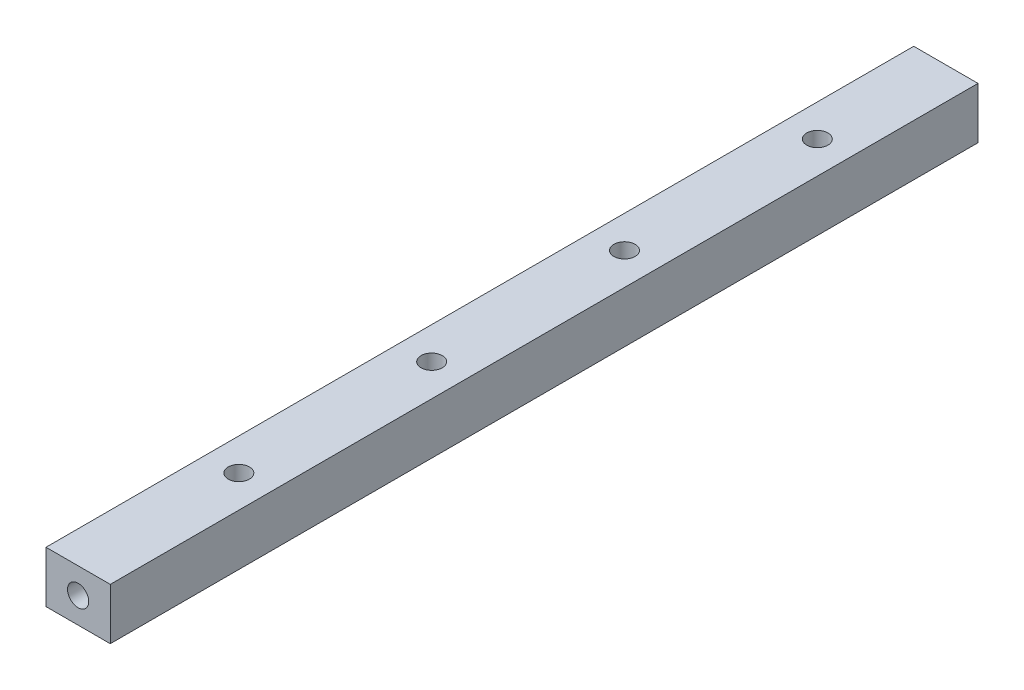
ISO-10303-21;
HEADER;
FILE_DESCRIPTION(('STEP AP214'),'2;1');
FILE_NAME('part.step','',(''),(''),'','','');
FILE_SCHEMA(('AUTOMOTIVE_DESIGN { 1 0 10303 214 1 1 1 1 }'));
ENDSEC;
DATA;
#1=APPLICATION_CONTEXT('core data for automotive mechanical design processes');
#2=APPLICATION_PROTOCOL_DEFINITION('international standard','automotive_design',2000,#1);
#3=PRODUCT_CONTEXT('',#1,'mechanical');
#4=PRODUCT('Part','Part','',(#3));
#5=PRODUCT_RELATED_PRODUCT_CATEGORY('part','',(#4));
#6=PRODUCT_DEFINITION_FORMATION('','',#4);
#7=PRODUCT_DEFINITION_CONTEXT('part definition',#1,'design');
#8=PRODUCT_DEFINITION('design','',#6,#7);
#9=PRODUCT_DEFINITION_SHAPE('','',#8);
#10=(LENGTH_UNIT() NAMED_UNIT(*) SI_UNIT(.MILLI.,.METRE.));
#11=(NAMED_UNIT(*) PLANE_ANGLE_UNIT() SI_UNIT($,.RADIAN.));
#12=(NAMED_UNIT(*) SI_UNIT($,.STERADIAN.) SOLID_ANGLE_UNIT());
#13=UNCERTAINTY_MEASURE_WITH_UNIT(LENGTH_MEASURE(1.E-05),#10,'distance_accuracy_value','');
#14=(GEOMETRIC_REPRESENTATION_CONTEXT(3) GLOBAL_UNCERTAINTY_ASSIGNED_CONTEXT((#13)) GLOBAL_UNIT_ASSIGNED_CONTEXT((#10,
#11,#12)) REPRESENTATION_CONTEXT('',''));
#15=CARTESIAN_POINT('',(0.,0.,0.));
#16=DIRECTION('',(0.,0.,1.));
#17=DIRECTION('',(1.,0.,0.));
#18=AXIS2_PLACEMENT_3D('',#15,#16,#17);
#19=CARTESIAN_POINT('',(-5.,4.,135.));
#20=DIRECTION('',(1.,0.,0.));
#21=DIRECTION('',(0.,0.,-1.));
#22=AXIS2_PLACEMENT_3D('',#19,#20,#21);
#23=PLANE('',#22);
#24=DIRECTION('',(0.,-1.,0.));
#25=VECTOR('',#24,1.);
#26=CARTESIAN_POINT('',(-5.,4.,0.));
#27=LINE('',#26,#25);
#28=CARTESIAN_POINT('',(-5.,4.,0.));
#29=VERTEX_POINT('',#28);
#30=CARTESIAN_POINT('',(-5.,-4.,0.));
#31=VERTEX_POINT('',#30);
#32=EDGE_CURVE('E96',#29,#31,#27,.T.);
#33=ORIENTED_EDGE('',*,*,#32,.T.);
#34=DIRECTION('',(0.,0.,-1.));
#35=VECTOR('',#34,1.);
#36=CARTESIAN_POINT('',(-5.,-4.,135.));
#37=LINE('',#36,#35);
#38=CARTESIAN_POINT('',(-5.,-4.,135.));
#39=VERTEX_POINT('',#38);
#40=EDGE_CURVE('E122',#39,#31,#37,.T.);
#41=ORIENTED_EDGE('',*,*,#40,.F.);
#42=DIRECTION('',(0.,-1.,0.));
#43=VECTOR('',#42,1.);
#44=CARTESIAN_POINT('',(-5.,4.,135.));
#45=LINE('',#44,#43);
#46=CARTESIAN_POINT('',(-5.,4.,135.));
#47=VERTEX_POINT('',#46);
#48=EDGE_CURVE('E107',#47,#39,#45,.T.);
#49=ORIENTED_EDGE('',*,*,#48,.F.);
#50=DIRECTION('',(0.,0.,-1.));
#51=VECTOR('',#50,1.);
#52=CARTESIAN_POINT('',(-5.,4.,135.));
#53=LINE('',#52,#51);
#54=EDGE_CURVE('E112',#47,#29,#53,.T.);
#55=ORIENTED_EDGE('',*,*,#54,.T.);
#56=EDGE_LOOP('',(#33,#41,#49,#55));
#57=FACE_BOUND('',#56,.T.);
#58=ADVANCED_FACE('F33',(#57),#23,.F.);
#59=CARTESIAN_POINT('',(-5.,-4.,135.));
#60=DIRECTION('',(0.,1.,0.));
#61=DIRECTION('',(0.,0.,1.));
#62=AXIS2_PLACEMENT_3D('',#59,#60,#61);
#63=PLANE('',#62);
#64=CARTESIAN_POINT('',(0.,-4.,50.));
#65=DIRECTION('',(0.,1.,0.));
#66=DIRECTION('',(0.,0.,1.));
#67=AXIS2_PLACEMENT_3D('',#64,#65,#66);
#68=CIRCLE('',#67,1.65);
#69=CARTESIAN_POINT('',(0.,-4.,51.65));
#70=VERTEX_POINT('',#69);
#71=EDGE_CURVE('E259',#70,#70,#68,.T.);
#72=ORIENTED_EDGE('',*,*,#71,.T.);
#73=EDGE_LOOP('',(#72));
#74=FACE_BOUND('',#73,.T.);
#75=CARTESIAN_POINT('',(0.,-4.,20.));
#76=DIRECTION('',(0.,1.,0.));
#77=DIRECTION('',(0.,0.,1.));
#78=AXIS2_PLACEMENT_3D('',#75,#76,#77);
#79=CIRCLE('',#78,1.65);
#80=CARTESIAN_POINT('',(0.,-4.,21.65));
#81=VERTEX_POINT('',#80);
#82=EDGE_CURVE('E103',#81,#81,#79,.T.);
#83=ORIENTED_EDGE('',*,*,#82,.T.);
#84=EDGE_LOOP('',(#83));
#85=FACE_BOUND('',#84,.T.);
#86=DIRECTION('',(1.,0.,0.));
#87=VECTOR('',#86,1.);
#88=CARTESIAN_POINT('',(-5.,-4.,0.));
#89=LINE('',#88,#87);
#90=CARTESIAN_POINT('',(5.,-4.,0.));
#91=VERTEX_POINT('',#90);
#92=EDGE_CURVE('E100',#31,#91,#89,.T.);
#93=ORIENTED_EDGE('',*,*,#92,.T.);
#94=DIRECTION('',(0.,0.,-1.));
#95=VECTOR('',#94,1.);
#96=CARTESIAN_POINT('',(5.,-4.,135.));
#97=LINE('',#96,#95);
#98=CARTESIAN_POINT('',(5.,-4.,135.));
#99=VERTEX_POINT('',#98);
#100=EDGE_CURVE('E120',#99,#91,#97,.T.);
#101=ORIENTED_EDGE('',*,*,#100,.F.);
#102=DIRECTION('',(1.,0.,0.));
#103=VECTOR('',#102,1.);
#104=CARTESIAN_POINT('',(-5.,-4.,135.));
#105=LINE('',#104,#103);
#106=EDGE_CURVE('E82',#39,#99,#105,.T.);
#107=ORIENTED_EDGE('',*,*,#106,.F.);
#108=ORIENTED_EDGE('',*,*,#40,.T.);
#109=EDGE_LOOP('',(#93,#101,#107,#108));
#110=FACE_BOUND('',#109,.T.);
#111=CARTESIAN_POINT('',(0.,-4.,80.));
#112=DIRECTION('',(0.,1.,0.));
#113=DIRECTION('',(0.,0.,1.));
#114=AXIS2_PLACEMENT_3D('',#111,#112,#113);
#115=CIRCLE('',#114,1.65);
#116=CARTESIAN_POINT('',(0.,-4.,81.65));
#117=VERTEX_POINT('',#116);
#118=EDGE_CURVE('E124',#117,#117,#115,.T.);
#119=ORIENTED_EDGE('',*,*,#118,.T.);
#120=EDGE_LOOP('',(#119));
#121=FACE_BOUND('',#120,.T.);
#122=CARTESIAN_POINT('',(0.,-4.,110.));
#123=DIRECTION('',(0.,1.,0.));
#124=DIRECTION('',(0.,0.,1.));
#125=AXIS2_PLACEMENT_3D('',#122,#123,#124);
#126=CIRCLE('',#125,1.65);
#127=CARTESIAN_POINT('',(0.,-4.,111.65));
#128=VERTEX_POINT('',#127);
#129=EDGE_CURVE('E42',#128,#128,#126,.T.);
#130=ORIENTED_EDGE('',*,*,#129,.T.);
#131=EDGE_LOOP('',(#130));
#132=FACE_BOUND('',#131,.T.);
#133=ADVANCED_FACE('F132',(#74,#85,#110,#121,#132),#63,.F.);
#134=CARTESIAN_POINT('',(5.,4.,135.));
#135=DIRECTION('',(-1.,0.,0.));
#136=DIRECTION('',(0.,-1.,0.));
#137=AXIS2_PLACEMENT_3D('',#134,#135,#136);
#138=PLANE('',#137);
#139=DIRECTION('',(0.,1.,0.));
#140=VECTOR('',#139,1.);
#141=CARTESIAN_POINT('',(5.,4.,0.));
#142=LINE('',#141,#140);
#143=CARTESIAN_POINT('',(5.,4.,0.));
#144=VERTEX_POINT('',#143);
#145=EDGE_CURVE('E68',#91,#144,#142,.T.);
#146=ORIENTED_EDGE('',*,*,#145,.T.);
#147=DIRECTION('',(0.,0.,-1.));
#148=VECTOR('',#147,1.);
#149=CARTESIAN_POINT('',(5.,4.,135.));
#150=LINE('',#149,#148);
#151=CARTESIAN_POINT('',(5.,4.,135.));
#152=VERTEX_POINT('',#151);
#153=EDGE_CURVE('E118',#152,#144,#150,.T.);
#154=ORIENTED_EDGE('',*,*,#153,.F.);
#155=DIRECTION('',(0.,1.,0.));
#156=VECTOR('',#155,1.);
#157=CARTESIAN_POINT('',(5.,4.,135.));
#158=LINE('',#157,#156);
#159=EDGE_CURVE('E110',#99,#152,#158,.T.);
#160=ORIENTED_EDGE('',*,*,#159,.F.);
#161=ORIENTED_EDGE('',*,*,#100,.T.);
#162=EDGE_LOOP('',(#146,#154,#160,#161));
#163=FACE_BOUND('',#162,.T.);
#164=ADVANCED_FACE('F142',(#163),#138,.F.);
#165=CARTESIAN_POINT('',(-5.,4.,135.));
#166=DIRECTION('',(0.,-1.,0.));
#167=DIRECTION('',(0.,0.,-1.));
#168=AXIS2_PLACEMENT_3D('',#165,#166,#167);
#169=PLANE('',#168);
#170=CARTESIAN_POINT('',(0.,4.,50.));
#171=DIRECTION('',(0.,1.,0.));
#172=DIRECTION('',(0.,0.,1.));
#173=AXIS2_PLACEMENT_3D('',#170,#171,#172);
#174=CIRCLE('',#173,1.64999999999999);
#175=CARTESIAN_POINT('',(0.,4.,51.65));
#176=VERTEX_POINT('',#175);
#177=EDGE_CURVE('E261',#176,#176,#174,.T.);
#178=ORIENTED_EDGE('',*,*,#177,.F.);
#179=EDGE_LOOP('',(#178));
#180=FACE_BOUND('',#179,.T.);
#181=CARTESIAN_POINT('',(0.,4.,20.));
#182=DIRECTION('',(0.,1.,0.));
#183=DIRECTION('',(0.,0.,1.));
#184=AXIS2_PLACEMENT_3D('',#181,#182,#183);
#185=CIRCLE('',#184,1.64999999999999);
#186=CARTESIAN_POINT('',(0.,4.,21.65));
#187=VERTEX_POINT('',#186);
#188=EDGE_CURVE('E262',#187,#187,#185,.T.);
#189=ORIENTED_EDGE('',*,*,#188,.F.);
#190=EDGE_LOOP('',(#189));
#191=FACE_BOUND('',#190,.T.);
#192=DIRECTION('',(-1.,0.,0.));
#193=VECTOR('',#192,1.);
#194=CARTESIAN_POINT('',(-5.,4.,0.));
#195=LINE('',#194,#193);
#196=EDGE_CURVE('E74',#144,#29,#195,.T.);
#197=ORIENTED_EDGE('',*,*,#196,.T.);
#198=ORIENTED_EDGE('',*,*,#54,.F.);
#199=DIRECTION('',(-1.,0.,0.));
#200=VECTOR('',#199,1.);
#201=CARTESIAN_POINT('',(-5.,4.,135.));
#202=LINE('',#201,#200);
#203=EDGE_CURVE('E50',#152,#47,#202,.T.);
#204=ORIENTED_EDGE('',*,*,#203,.F.);
#205=ORIENTED_EDGE('',*,*,#153,.T.);
#206=EDGE_LOOP('',(#197,#198,#204,#205));
#207=FACE_BOUND('',#206,.T.);
#208=CARTESIAN_POINT('',(0.,4.,80.));
#209=DIRECTION('',(0.,1.,0.));
#210=DIRECTION('',(0.,0.,1.));
#211=AXIS2_PLACEMENT_3D('',#208,#209,#210);
#212=CIRCLE('',#211,1.64999999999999);
#213=CARTESIAN_POINT('',(0.,4.,81.65));
#214=VERTEX_POINT('',#213);
#215=EDGE_CURVE('E127',#214,#214,#212,.T.);
#216=ORIENTED_EDGE('',*,*,#215,.F.);
#217=EDGE_LOOP('',(#216));
#218=FACE_BOUND('',#217,.T.);
#219=CARTESIAN_POINT('',(0.,4.,110.));
#220=DIRECTION('',(0.,1.,0.));
#221=DIRECTION('',(0.,0.,1.));
#222=AXIS2_PLACEMENT_3D('',#219,#220,#221);
#223=CIRCLE('',#222,1.64999999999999);
#224=CARTESIAN_POINT('',(0.,4.,111.65));
#225=VERTEX_POINT('',#224);
#226=EDGE_CURVE('E11',#225,#225,#223,.T.);
#227=ORIENTED_EDGE('',*,*,#226,.F.);
#228=EDGE_LOOP('',(#227));
#229=FACE_BOUND('',#228,.T.);
#230=ADVANCED_FACE('F139',(#180,#191,#207,#218,#229),#169,.F.);
#231=CARTESIAN_POINT('',(-5.,-4.,135.));
#232=DIRECTION('',(0.,0.,1.));
#233=DIRECTION('',(1.,0.,0.));
#234=AXIS2_PLACEMENT_3D('',#231,#232,#233);
#235=PLANE('',#234);
#236=CARTESIAN_POINT('',(0.,0.,135.));
#237=DIRECTION('',(0.,0.,1.));
#238=DIRECTION('',(1.,0.,0.));
#239=AXIS2_PLACEMENT_3D('',#236,#237,#238);
#240=CIRCLE('',#239,1.64999999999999);
#241=CARTESIAN_POINT('',(1.64999999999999,0.,135.));
#242=VERTEX_POINT('',#241);
#243=EDGE_CURVE('E97',#242,#242,#240,.T.);
#244=ORIENTED_EDGE('',*,*,#243,.F.);
#245=EDGE_LOOP('',(#244));
#246=FACE_BOUND('',#245,.T.);
#247=ORIENTED_EDGE('',*,*,#48,.T.);
#248=ORIENTED_EDGE('',*,*,#106,.T.);
#249=ORIENTED_EDGE('',*,*,#159,.T.);
#250=ORIENTED_EDGE('',*,*,#203,.T.);
#251=EDGE_LOOP('',(#247,#248,#249,#250));
#252=FACE_BOUND('',#251,.T.);
#253=ADVANCED_FACE('F141',(#246,#252),#235,.T.);
#254=CARTESIAN_POINT('',(-5.,-4.,0.));
#255=DIRECTION('',(0.,0.,1.));
#256=DIRECTION('',(1.,0.,0.));
#257=AXIS2_PLACEMENT_3D('',#254,#255,#256);
#258=PLANE('',#257);
#259=ORIENTED_EDGE('',*,*,#32,.F.);
#260=ORIENTED_EDGE('',*,*,#196,.F.);
#261=ORIENTED_EDGE('',*,*,#145,.F.);
#262=ORIENTED_EDGE('',*,*,#92,.F.);
#263=EDGE_LOOP('',(#259,#260,#261,#262));
#264=FACE_BOUND('',#263,.T.);
#265=ADVANCED_FACE('F90',(#264),#258,.F.);
#266=CARTESIAN_POINT('',(0.,0.,115.));
#267=DIRECTION('',(0.,0.,1.));
#268=DIRECTION('',(1.,0.,0.));
#269=AXIS2_PLACEMENT_3D('',#266,#267,#268);
#270=CONICAL_SURFACE('',#269,1.64999999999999,1.02974425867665);
#271=CARTESIAN_POINT('',(0.,0.,114.008579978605));
#272=VERTEX_POINT('',#271);
#273=VERTEX_LOOP('',#272);
#274=FACE_BOUND('',#273,.T.);
#275=CARTESIAN_POINT('',(0.,0.,115.));
#276=DIRECTION('',(0.,0.,1.));
#277=DIRECTION('',(1.,0.,0.));
#278=AXIS2_PLACEMENT_3D('',#275,#276,#277);
#279=CIRCLE('',#278,1.64999999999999);
#280=CARTESIAN_POINT('',(1.64999999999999,0.,115.));
#281=VERTEX_POINT('',#280);
#282=EDGE_CURVE('E94',#281,#281,#279,.T.);
#283=ORIENTED_EDGE('',*,*,#282,.T.);
#284=EDGE_LOOP('',(#283));
#285=FACE_BOUND('',#284,.T.);
#286=ADVANCED_FACE('F86',(#274,#285),#270,.F.);
#287=CARTESIAN_POINT('',(0.,0.,135.));
#288=DIRECTION('',(0.,0.,1.));
#289=DIRECTION('',(1.,0.,0.));
#290=AXIS2_PLACEMENT_3D('',#287,#288,#289);
#291=CYLINDRICAL_SURFACE('',#290,1.64999999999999);
#292=ORIENTED_EDGE('',*,*,#282,.F.);
#293=EDGE_LOOP('',(#292));
#294=FACE_BOUND('',#293,.T.);
#295=ORIENTED_EDGE('',*,*,#243,.T.);
#296=EDGE_LOOP('',(#295));
#297=FACE_BOUND('',#296,.T.);
#298=ADVANCED_FACE('F89',(#294,#297),#291,.F.);
#299=CARTESIAN_POINT('',(0.,4.,20.));
#300=DIRECTION('',(0.,1.,0.));
#301=DIRECTION('',(0.,0.,1.));
#302=AXIS2_PLACEMENT_3D('',#299,#300,#301);
#303=CYLINDRICAL_SURFACE('',#302,1.64999999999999);
#304=ORIENTED_EDGE('',*,*,#82,.F.);
#305=EDGE_LOOP('',(#304));
#306=FACE_BOUND('',#305,.T.);
#307=ORIENTED_EDGE('',*,*,#188,.T.);
#308=EDGE_LOOP('',(#307));
#309=FACE_BOUND('',#308,.T.);
#310=ADVANCED_FACE('F169',(#306,#309),#303,.F.);
#311=CARTESIAN_POINT('',(0.,4.,50.));
#312=DIRECTION('',(0.,1.,0.));
#313=DIRECTION('',(0.,0.,1.));
#314=AXIS2_PLACEMENT_3D('',#311,#312,#313);
#315=CYLINDRICAL_SURFACE('',#314,1.64999999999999);
#316=ORIENTED_EDGE('',*,*,#71,.F.);
#317=EDGE_LOOP('',(#316));
#318=FACE_BOUND('',#317,.T.);
#319=ORIENTED_EDGE('',*,*,#177,.T.);
#320=EDGE_LOOP('',(#319));
#321=FACE_BOUND('',#320,.T.);
#322=ADVANCED_FACE('F164',(#318,#321),#315,.F.);
#323=CARTESIAN_POINT('',(0.,4.,80.));
#324=DIRECTION('',(0.,1.,0.));
#325=DIRECTION('',(0.,0.,1.));
#326=AXIS2_PLACEMENT_3D('',#323,#324,#325);
#327=CYLINDRICAL_SURFACE('',#326,1.64999999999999);
#328=ORIENTED_EDGE('',*,*,#118,.F.);
#329=EDGE_LOOP('',(#328));
#330=FACE_BOUND('',#329,.T.);
#331=ORIENTED_EDGE('',*,*,#215,.T.);
#332=EDGE_LOOP('',(#331));
#333=FACE_BOUND('',#332,.T.);
#334=ADVANCED_FACE('F136',(#330,#333),#327,.F.);
#335=CARTESIAN_POINT('',(0.,4.,110.));
#336=DIRECTION('',(0.,1.,0.));
#337=DIRECTION('',(0.,0.,1.));
#338=AXIS2_PLACEMENT_3D('',#335,#336,#337);
#339=CYLINDRICAL_SURFACE('',#338,1.64999999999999);
#340=ORIENTED_EDGE('',*,*,#129,.F.);
#341=EDGE_LOOP('',(#340));
#342=FACE_BOUND('',#341,.T.);
#343=ORIENTED_EDGE('',*,*,#226,.T.);
#344=EDGE_LOOP('',(#343));
#345=FACE_BOUND('',#344,.T.);
#346=ADVANCED_FACE('F35',(#342,#345),#339,.F.);
#347=CLOSED_SHELL('',(#58,#133,#164,#230,#253,#265,#286,#298,#310,#322,#334,#346));
#348=MANIFOLD_SOLID_BREP('B2',#347);
#349=ADVANCED_BREP_SHAPE_REPRESENTATION('',(#18,#348),#14);
#350=SHAPE_DEFINITION_REPRESENTATION(#9,#349);
ENDSEC;
END-ISO-10303-21;
